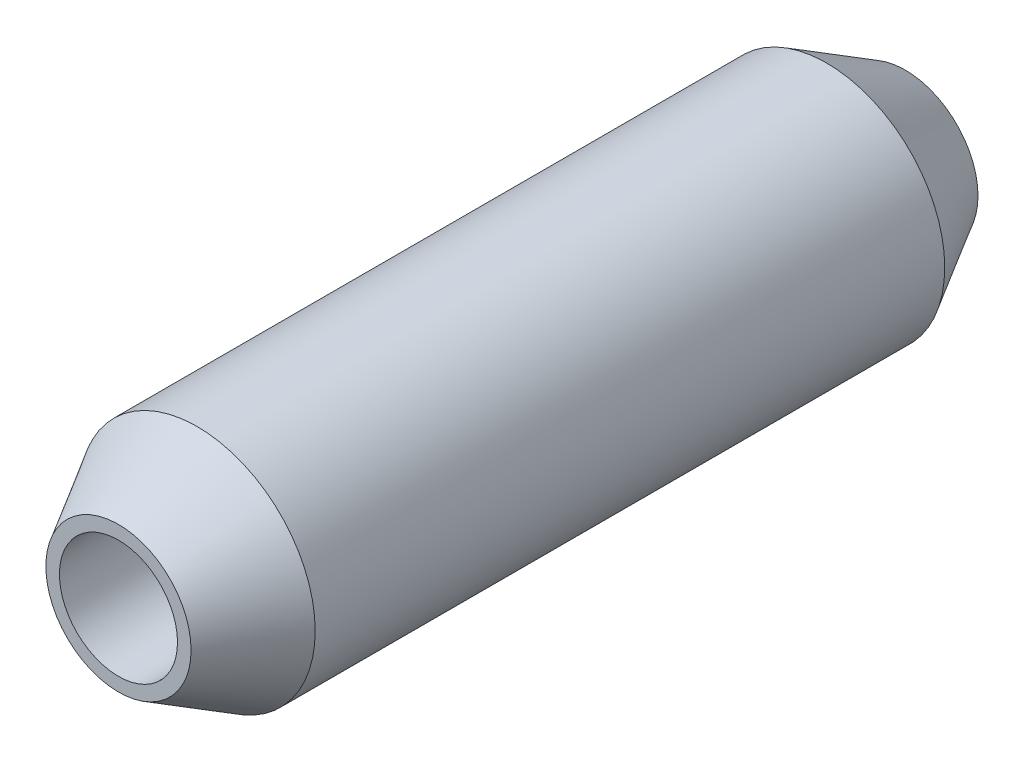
ISO-10303-21;
HEADER;
FILE_DESCRIPTION(('STEP AP214'),'2;1');
FILE_NAME('part.step','',(''),(''),'','','');
FILE_SCHEMA(('AUTOMOTIVE_DESIGN { 1 0 10303 214 1 1 1 1 }'));
ENDSEC;
DATA;
#1=APPLICATION_CONTEXT('core data for automotive mechanical design processes');
#2=APPLICATION_PROTOCOL_DEFINITION('international standard','automotive_design',2000,#1);
#3=PRODUCT_CONTEXT('',#1,'mechanical');
#4=PRODUCT('Part','Part','',(#3));
#5=PRODUCT_RELATED_PRODUCT_CATEGORY('part','',(#4));
#6=PRODUCT_DEFINITION_FORMATION('','',#4);
#7=PRODUCT_DEFINITION_CONTEXT('part definition',#1,'design');
#8=PRODUCT_DEFINITION('design','',#6,#7);
#9=PRODUCT_DEFINITION_SHAPE('','',#8);
#10=(LENGTH_UNIT() NAMED_UNIT(*) SI_UNIT(.MILLI.,.METRE.));
#11=(NAMED_UNIT(*) PLANE_ANGLE_UNIT() SI_UNIT($,.RADIAN.));
#12=(NAMED_UNIT(*) SI_UNIT($,.STERADIAN.) SOLID_ANGLE_UNIT());
#13=UNCERTAINTY_MEASURE_WITH_UNIT(LENGTH_MEASURE(1.E-05),#10,'distance_accuracy_value','');
#14=(GEOMETRIC_REPRESENTATION_CONTEXT(3) GLOBAL_UNCERTAINTY_ASSIGNED_CONTEXT((#13)) GLOBAL_UNIT_ASSIGNED_CONTEXT((#10,
#11,#12)) REPRESENTATION_CONTEXT('',''));
#15=CARTESIAN_POINT('',(0.,0.,0.));
#16=DIRECTION('',(0.,0.,1.));
#17=DIRECTION('',(1.,0.,0.));
#18=AXIS2_PLACEMENT_3D('',#15,#16,#17);
#19=CARTESIAN_POINT('',(0.,0.,0.));
#20=DIRECTION('',(0.,0.,1.));
#21=DIRECTION('',(1.,0.,0.));
#22=AXIS2_PLACEMENT_3D('',#19,#20,#21);
#23=PLANE('',#22);
#24=CARTESIAN_POINT('',(0.,0.,0.));
#25=DIRECTION('',(0.,0.,1.));
#26=DIRECTION('',(1.,0.,0.));
#27=AXIS2_PLACEMENT_3D('',#24,#25,#26);
#28=CIRCLE('',#27,1.84529946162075);
#29=CARTESIAN_POINT('',(1.84529946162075,0.,0.));
#30=VERTEX_POINT('',#29);
#31=EDGE_CURVE('E8',#30,#30,#28,.T.);
#32=ORIENTED_EDGE('',*,*,#31,.F.);
#33=EDGE_LOOP('',(#32));
#34=FACE_BOUND('',#33,.T.);
#35=ADVANCED_FACE('F13',(#34),#23,.F.);
#36=CARTESIAN_POINT('',(0.,0.,2.));
#37=DIRECTION('',(0.,0.,1.));
#38=DIRECTION('',(1.,0.,0.));
#39=AXIS2_PLACEMENT_3D('',#36,#37,#38);
#40=CONICAL_SURFACE('',#39,3.,0.523598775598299);
#41=ORIENTED_EDGE('',*,*,#31,.T.);
#42=EDGE_LOOP('',(#41));
#43=FACE_BOUND('',#42,.T.);
#44=CARTESIAN_POINT('',(0.,0.,2.));
#45=DIRECTION('',(0.,0.,1.));
#46=DIRECTION('',(1.,0.,0.));
#47=AXIS2_PLACEMENT_3D('',#44,#45,#46);
#48=CIRCLE('',#47,3.);
#49=CARTESIAN_POINT('',(3.,0.,2.));
#50=VERTEX_POINT('',#49);
#51=EDGE_CURVE('E19',#50,#50,#48,.T.);
#52=ORIENTED_EDGE('',*,*,#51,.F.);
#53=EDGE_LOOP('',(#52));
#54=FACE_BOUND('',#53,.T.);
#55=ADVANCED_FACE('F61',(#43,#54),#40,.T.);
#56=CARTESIAN_POINT('',(0.,0.,50.));
#57=DIRECTION('',(0.,0.,1.));
#58=DIRECTION('',(1.,0.,0.));
#59=AXIS2_PLACEMENT_3D('',#56,#57,#58);
#60=CYLINDRICAL_SURFACE('',#59,3.);
#61=CARTESIAN_POINT('',(0.,0.,18.));
#62=DIRECTION('',(0.,0.,1.));
#63=DIRECTION('',(1.,0.,0.));
#64=AXIS2_PLACEMENT_3D('',#61,#62,#63);
#65=CIRCLE('',#64,3.);
#66=CARTESIAN_POINT('',(3.,0.,18.));
#67=VERTEX_POINT('',#66);
#68=EDGE_CURVE('E23',#67,#67,#65,.T.);
#69=ORIENTED_EDGE('',*,*,#68,.F.);
#70=EDGE_LOOP('',(#69));
#71=FACE_BOUND('',#70,.T.);
#72=ORIENTED_EDGE('',*,*,#51,.T.);
#73=EDGE_LOOP('',(#72));
#74=FACE_BOUND('',#73,.T.);
#75=ADVANCED_FACE('F56',(#71,#74),#60,.T.);
#76=CARTESIAN_POINT('',(0.,0.,18.));
#77=DIRECTION('',(0.,0.,-1.));
#78=DIRECTION('',(-1.,0.,0.));
#79=AXIS2_PLACEMENT_3D('',#76,#77,#78);
#80=CONICAL_SURFACE('',#79,3.,0.5235987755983);
#81=CARTESIAN_POINT('',(0.,0.,20.));
#82=DIRECTION('',(0.,0.,1.));
#83=DIRECTION('',(1.,0.,0.));
#84=AXIS2_PLACEMENT_3D('',#81,#82,#83);
#85=CIRCLE('',#84,1.84529946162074);
#86=CARTESIAN_POINT('',(1.84529946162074,0.,20.));
#87=VERTEX_POINT('',#86);
#88=EDGE_CURVE('E27',#87,#87,#85,.T.);
#89=ORIENTED_EDGE('',*,*,#88,.F.);
#90=EDGE_LOOP('',(#89));
#91=FACE_BOUND('',#90,.T.);
#92=ORIENTED_EDGE('',*,*,#68,.T.);
#93=EDGE_LOOP('',(#92));
#94=FACE_BOUND('',#93,.T.);
#95=ADVANCED_FACE('F50',(#91,#94),#80,.T.);
#96=CARTESIAN_POINT('',(1.84529946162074,0.,20.));
#97=DIRECTION('',(0.,0.,-1.));
#98=DIRECTION('',(-1.,0.,0.));
#99=AXIS2_PLACEMENT_3D('',#96,#97,#98);
#100=PLANE('',#99);
#101=CARTESIAN_POINT('',(0.,0.,20.));
#102=DIRECTION('',(0.,0.,1.));
#103=DIRECTION('',(1.,0.,0.));
#104=AXIS2_PLACEMENT_3D('',#101,#102,#103);
#105=CIRCLE('',#104,1.5);
#106=CARTESIAN_POINT('',(1.5,0.,20.));
#107=VERTEX_POINT('',#106);
#108=EDGE_CURVE('E32',#107,#107,#105,.T.);
#109=ORIENTED_EDGE('',*,*,#108,.F.);
#110=EDGE_LOOP('',(#109));
#111=FACE_BOUND('',#110,.T.);
#112=ORIENTED_EDGE('',*,*,#88,.T.);
#113=EDGE_LOOP('',(#112));
#114=FACE_BOUND('',#113,.T.);
#115=ADVANCED_FACE('F44',(#111,#114),#100,.F.);
#116=CARTESIAN_POINT('',(0.,0.,50.));
#117=DIRECTION('',(0.,0.,1.));
#118=DIRECTION('',(1.,0.,0.));
#119=AXIS2_PLACEMENT_3D('',#116,#117,#118);
#120=CYLINDRICAL_SURFACE('',#119,1.5);
#121=CARTESIAN_POINT('',(0.,0.,14.));
#122=DIRECTION('',(0.,0.,1.));
#123=DIRECTION('',(1.,0.,0.));
#124=AXIS2_PLACEMENT_3D('',#121,#122,#123);
#125=CIRCLE('',#124,1.5);
#126=CARTESIAN_POINT('',(1.5,0.,14.));
#127=VERTEX_POINT('',#126);
#128=EDGE_CURVE('E35',#127,#127,#125,.T.);
#129=ORIENTED_EDGE('',*,*,#128,.F.);
#130=EDGE_LOOP('',(#129));
#131=FACE_BOUND('',#130,.T.);
#132=ORIENTED_EDGE('',*,*,#108,.T.);
#133=EDGE_LOOP('',(#132));
#134=FACE_BOUND('',#133,.T.);
#135=ADVANCED_FACE('F41',(#131,#134),#120,.F.);
#136=CARTESIAN_POINT('',(0.,0.,14.));
#137=DIRECTION('',(0.,0.,1.));
#138=DIRECTION('',(1.,0.,0.));
#139=AXIS2_PLACEMENT_3D('',#136,#137,#138);
#140=PLANE('',#139);
#141=ORIENTED_EDGE('',*,*,#128,.T.);
#142=EDGE_LOOP('',(#141));
#143=FACE_BOUND('',#142,.T.);
#144=ADVANCED_FACE('F39',(#143),#140,.T.);
#145=CLOSED_SHELL('',(#35,#55,#75,#95,#115,#135,#144));
#146=MANIFOLD_SOLID_BREP('B1',#145);
#147=ADVANCED_BREP_SHAPE_REPRESENTATION('',(#18,#146),#14);
#148=SHAPE_DEFINITION_REPRESENTATION(#9,#147);
ENDSEC;
END-ISO-10303-21;
